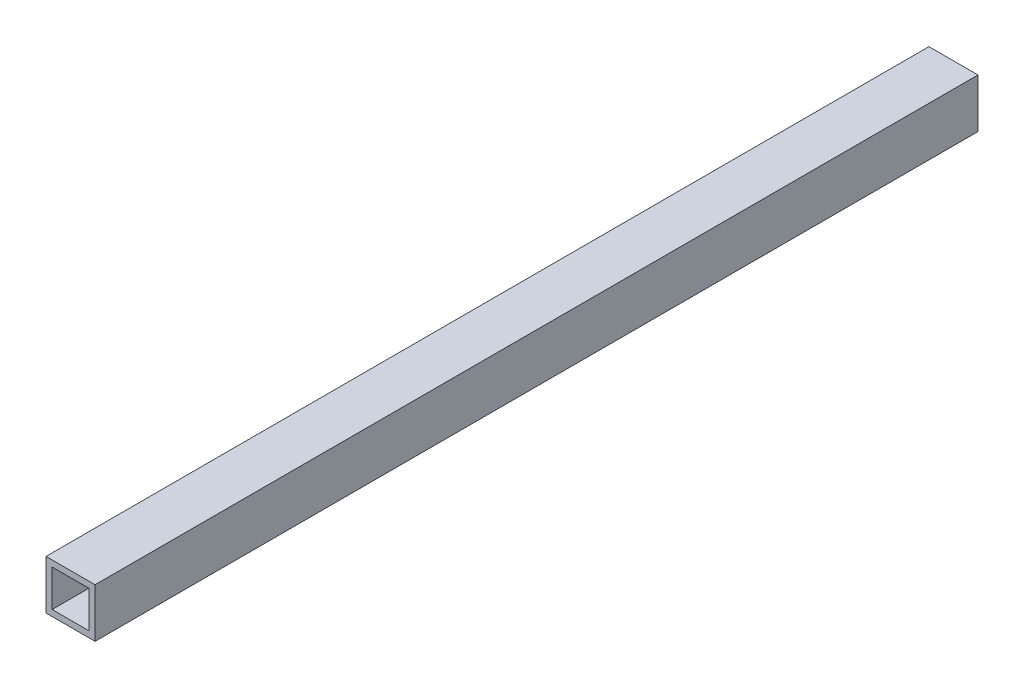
ISO-10303-21;
HEADER;
FILE_DESCRIPTION(('STEP AP214'),'2;1');
FILE_NAME('part.step','',(''),(''),'','','');
FILE_SCHEMA(('AUTOMOTIVE_DESIGN { 1 0 10303 214 1 1 1 1 }'));
ENDSEC;
DATA;
#1=APPLICATION_CONTEXT('core data for automotive mechanical design processes');
#2=APPLICATION_PROTOCOL_DEFINITION('international standard','automotive_design',2000,#1);
#3=PRODUCT_CONTEXT('',#1,'mechanical');
#4=PRODUCT('Part','Part','',(#3));
#5=PRODUCT_RELATED_PRODUCT_CATEGORY('part','',(#4));
#6=PRODUCT_DEFINITION_FORMATION('','',#4);
#7=PRODUCT_DEFINITION_CONTEXT('part definition',#1,'design');
#8=PRODUCT_DEFINITION('design','',#6,#7);
#9=PRODUCT_DEFINITION_SHAPE('','',#8);
#10=(LENGTH_UNIT() NAMED_UNIT(*) SI_UNIT(.MILLI.,.METRE.));
#11=(NAMED_UNIT(*) PLANE_ANGLE_UNIT() SI_UNIT($,.RADIAN.));
#12=(NAMED_UNIT(*) SI_UNIT($,.STERADIAN.) SOLID_ANGLE_UNIT());
#13=UNCERTAINTY_MEASURE_WITH_UNIT(LENGTH_MEASURE(1.E-05),#10,'distance_accuracy_value','');
#14=(GEOMETRIC_REPRESENTATION_CONTEXT(3) GLOBAL_UNCERTAINTY_ASSIGNED_CONTEXT((#13)) GLOBAL_UNIT_ASSIGNED_CONTEXT((#10,
#11,#12)) REPRESENTATION_CONTEXT('',''));
#15=CARTESIAN_POINT('',(0.,0.,0.));
#16=DIRECTION('',(0.,0.,1.));
#17=DIRECTION('',(1.,0.,0.));
#18=AXIS2_PLACEMENT_3D('',#15,#16,#17);
#19=CARTESIAN_POINT('',(0.,25.4,457.2));
#20=DIRECTION('',(0.,0.,-1.));
#21=DIRECTION('',(-1.,0.,0.));
#22=AXIS2_PLACEMENT_3D('',#19,#20,#21);
#23=PLANE('',#22);
#24=DIRECTION('',(0.,-1.,0.));
#25=VECTOR('',#24,1.);
#26=CARTESIAN_POINT('',(0.,0.,457.2));
#27=LINE('',#26,#25);
#28=CARTESIAN_POINT('',(0.,25.4,457.2));
#29=VERTEX_POINT('',#28);
#30=CARTESIAN_POINT('',(0.,0.,457.2));
#31=VERTEX_POINT('',#30);
#32=EDGE_CURVE('E132',#29,#31,#27,.T.);
#33=ORIENTED_EDGE('',*,*,#32,.T.);
#34=DIRECTION('',(1.,0.,0.));
#35=VECTOR('',#34,1.);
#36=CARTESIAN_POINT('',(0.,0.,457.2));
#37=LINE('',#36,#35);
#38=CARTESIAN_POINT('',(25.4,0.,457.2));
#39=VERTEX_POINT('',#38);
#40=EDGE_CURVE('E135',#31,#39,#37,.T.);
#41=ORIENTED_EDGE('',*,*,#40,.T.);
#42=DIRECTION('',(0.,1.,0.));
#43=VECTOR('',#42,1.);
#44=CARTESIAN_POINT('',(25.4,0.,457.2));
#45=LINE('',#44,#43);
#46=CARTESIAN_POINT('',(25.4,25.4,457.2));
#47=VERTEX_POINT('',#46);
#48=EDGE_CURVE('E138',#39,#47,#45,.T.);
#49=ORIENTED_EDGE('',*,*,#48,.T.);
#50=DIRECTION('',(-1.,0.,0.));
#51=VECTOR('',#50,1.);
#52=CARTESIAN_POINT('',(0.,25.4,457.2));
#53=LINE('',#52,#51);
#54=EDGE_CURVE('E140',#47,#29,#53,.T.);
#55=ORIENTED_EDGE('',*,*,#54,.T.);
#56=EDGE_LOOP('',(#33,#41,#49,#55));
#57=FACE_BOUND('',#56,.T.);
#58=DIRECTION('',(0.,-1.,0.));
#59=VECTOR('',#58,1.);
#60=CARTESIAN_POINT('',(3.175,3.175,457.2));
#61=LINE('',#60,#59);
#62=CARTESIAN_POINT('',(3.175,22.225,457.2));
#63=VERTEX_POINT('',#62);
#64=CARTESIAN_POINT('',(3.175,3.175,457.2));
#65=VERTEX_POINT('',#64);
#66=EDGE_CURVE('E96',#63,#65,#61,.T.);
#67=ORIENTED_EDGE('',*,*,#66,.F.);
#68=DIRECTION('',(-1.,0.,0.));
#69=VECTOR('',#68,1.);
#70=CARTESIAN_POINT('',(3.175,22.225,457.2));
#71=LINE('',#70,#69);
#72=CARTESIAN_POINT('',(22.225,22.225,457.2));
#73=VERTEX_POINT('',#72);
#74=EDGE_CURVE('E118',#73,#63,#71,.T.);
#75=ORIENTED_EDGE('',*,*,#74,.F.);
#76=DIRECTION('',(0.,1.,0.));
#77=VECTOR('',#76,1.);
#78=CARTESIAN_POINT('',(22.225,3.175,457.2));
#79=LINE('',#78,#77);
#80=CARTESIAN_POINT('',(22.225,3.175,457.2));
#81=VERTEX_POINT('',#80);
#82=EDGE_CURVE('E116',#81,#73,#79,.T.);
#83=ORIENTED_EDGE('',*,*,#82,.F.);
#84=DIRECTION('',(1.,0.,0.));
#85=VECTOR('',#84,1.);
#86=CARTESIAN_POINT('',(3.175,3.175,457.2));
#87=LINE('',#86,#85);
#88=EDGE_CURVE('E104',#65,#81,#87,.T.);
#89=ORIENTED_EDGE('',*,*,#88,.F.);
#90=EDGE_LOOP('',(#67,#75,#83,#89));
#91=FACE_BOUND('',#90,.T.);
#92=ADVANCED_FACE('F31',(#57,#91),#23,.F.);
#93=CARTESIAN_POINT('',(0.,25.4,0.));
#94=DIRECTION('',(0.,0.,-1.));
#95=DIRECTION('',(-1.,0.,0.));
#96=AXIS2_PLACEMENT_3D('',#93,#94,#95);
#97=PLANE('',#96);
#98=DIRECTION('',(0.,-1.,0.));
#99=VECTOR('',#98,1.);
#100=CARTESIAN_POINT('',(0.,0.,0.));
#101=LINE('',#100,#99);
#102=CARTESIAN_POINT('',(0.,25.4,0.));
#103=VERTEX_POINT('',#102);
#104=CARTESIAN_POINT('',(0.,0.,0.));
#105=VERTEX_POINT('',#104);
#106=EDGE_CURVE('E112',#103,#105,#101,.T.);
#107=ORIENTED_EDGE('',*,*,#106,.F.);
#108=DIRECTION('',(-1.,0.,0.));
#109=VECTOR('',#108,1.);
#110=CARTESIAN_POINT('',(0.,25.4,0.));
#111=LINE('',#110,#109);
#112=CARTESIAN_POINT('',(25.4,25.4,0.));
#113=VERTEX_POINT('',#112);
#114=EDGE_CURVE('E136',#113,#103,#111,.T.);
#115=ORIENTED_EDGE('',*,*,#114,.F.);
#116=DIRECTION('',(0.,1.,0.));
#117=VECTOR('',#116,1.);
#118=CARTESIAN_POINT('',(25.4,0.,0.));
#119=LINE('',#118,#117);
#120=CARTESIAN_POINT('',(25.4,0.,0.));
#121=VERTEX_POINT('',#120);
#122=EDGE_CURVE('E147',#121,#113,#119,.T.);
#123=ORIENTED_EDGE('',*,*,#122,.F.);
#124=DIRECTION('',(1.,0.,0.));
#125=VECTOR('',#124,1.);
#126=CARTESIAN_POINT('',(0.,0.,0.));
#127=LINE('',#126,#125);
#128=EDGE_CURVE('E145',#105,#121,#127,.T.);
#129=ORIENTED_EDGE('',*,*,#128,.F.);
#130=EDGE_LOOP('',(#107,#115,#123,#129));
#131=FACE_BOUND('',#130,.T.);
#132=DIRECTION('',(-1.,0.,0.));
#133=VECTOR('',#132,1.);
#134=CARTESIAN_POINT('',(3.175,22.225,0.));
#135=LINE('',#134,#133);
#136=CARTESIAN_POINT('',(22.225,22.225,0.));
#137=VERTEX_POINT('',#136);
#138=CARTESIAN_POINT('',(3.175,22.225,0.));
#139=VERTEX_POINT('',#138);
#140=EDGE_CURVE('E105',#137,#139,#135,.T.);
#141=ORIENTED_EDGE('',*,*,#140,.T.);
#142=DIRECTION('',(0.,-1.,0.));
#143=VECTOR('',#142,1.);
#144=CARTESIAN_POINT('',(3.175,3.175,0.));
#145=LINE('',#144,#143);
#146=CARTESIAN_POINT('',(3.175,3.175,0.));
#147=VERTEX_POINT('',#146);
#148=EDGE_CURVE('E54',#139,#147,#145,.T.);
#149=ORIENTED_EDGE('',*,*,#148,.T.);
#150=DIRECTION('',(1.,0.,0.));
#151=VECTOR('',#150,1.);
#152=CARTESIAN_POINT('',(3.175,3.175,0.));
#153=LINE('',#152,#151);
#154=CARTESIAN_POINT('',(22.225,3.175,0.));
#155=VERTEX_POINT('',#154);
#156=EDGE_CURVE('E111',#147,#155,#153,.T.);
#157=ORIENTED_EDGE('',*,*,#156,.T.);
#158=DIRECTION('',(0.,1.,0.));
#159=VECTOR('',#158,1.);
#160=CARTESIAN_POINT('',(22.225,3.175,0.));
#161=LINE('',#160,#159);
#162=EDGE_CURVE('E124',#155,#137,#161,.T.);
#163=ORIENTED_EDGE('',*,*,#162,.T.);
#164=EDGE_LOOP('',(#141,#149,#157,#163));
#165=FACE_BOUND('',#164,.T.);
#166=ADVANCED_FACE('F165',(#131,#165),#97,.T.);
#167=CARTESIAN_POINT('',(0.,0.,457.2));
#168=DIRECTION('',(1.,0.,0.));
#169=DIRECTION('',(0.,0.,-1.));
#170=AXIS2_PLACEMENT_3D('',#167,#168,#169);
#171=PLANE('',#170);
#172=ORIENTED_EDGE('',*,*,#106,.T.);
#173=DIRECTION('',(0.,0.,-1.));
#174=VECTOR('',#173,1.);
#175=CARTESIAN_POINT('',(0.,0.,457.2));
#176=LINE('',#175,#174);
#177=EDGE_CURVE('E11',#31,#105,#176,.T.);
#178=ORIENTED_EDGE('',*,*,#177,.F.);
#179=ORIENTED_EDGE('',*,*,#32,.F.);
#180=DIRECTION('',(0.,0.,-1.));
#181=VECTOR('',#180,1.);
#182=CARTESIAN_POINT('',(0.,25.4,457.2));
#183=LINE('',#182,#181);
#184=EDGE_CURVE('E142',#29,#103,#183,.T.);
#185=ORIENTED_EDGE('',*,*,#184,.T.);
#186=EDGE_LOOP('',(#172,#178,#179,#185));
#187=FACE_BOUND('',#186,.T.);
#188=ADVANCED_FACE('F33',(#187),#171,.F.);
#189=CARTESIAN_POINT('',(0.,0.,457.2));
#190=DIRECTION('',(0.,1.,0.));
#191=DIRECTION('',(0.,0.,1.));
#192=AXIS2_PLACEMENT_3D('',#189,#190,#191);
#193=PLANE('',#192);
#194=ORIENTED_EDGE('',*,*,#128,.T.);
#195=DIRECTION('',(0.,0.,-1.));
#196=VECTOR('',#195,1.);
#197=CARTESIAN_POINT('',(25.4,0.,457.2));
#198=LINE('',#197,#196);
#199=EDGE_CURVE('E39',#39,#121,#198,.T.);
#200=ORIENTED_EDGE('',*,*,#199,.F.);
#201=ORIENTED_EDGE('',*,*,#40,.F.);
#202=ORIENTED_EDGE('',*,*,#177,.T.);
#203=EDGE_LOOP('',(#194,#200,#201,#202));
#204=FACE_BOUND('',#203,.T.);
#205=ADVANCED_FACE('F175',(#204),#193,.F.);
#206=CARTESIAN_POINT('',(25.4,0.,457.2));
#207=DIRECTION('',(-1.,0.,0.));
#208=DIRECTION('',(0.,0.,1.));
#209=AXIS2_PLACEMENT_3D('',#206,#207,#208);
#210=PLANE('',#209);
#211=ORIENTED_EDGE('',*,*,#122,.T.);
#212=DIRECTION('',(0.,0.,-1.));
#213=VECTOR('',#212,1.);
#214=CARTESIAN_POINT('',(25.4,25.4,457.2));
#215=LINE('',#214,#213);
#216=EDGE_CURVE('E152',#47,#113,#215,.T.);
#217=ORIENTED_EDGE('',*,*,#216,.F.);
#218=ORIENTED_EDGE('',*,*,#48,.F.);
#219=ORIENTED_EDGE('',*,*,#199,.T.);
#220=EDGE_LOOP('',(#211,#217,#218,#219));
#221=FACE_BOUND('',#220,.T.);
#222=ADVANCED_FACE('F159',(#221),#210,.F.);
#223=CARTESIAN_POINT('',(0.,25.4,457.2));
#224=DIRECTION('',(0.,-1.,0.));
#225=DIRECTION('',(0.,0.,-1.));
#226=AXIS2_PLACEMENT_3D('',#223,#224,#225);
#227=PLANE('',#226);
#228=ORIENTED_EDGE('',*,*,#114,.T.);
#229=ORIENTED_EDGE('',*,*,#184,.F.);
#230=ORIENTED_EDGE('',*,*,#54,.F.);
#231=ORIENTED_EDGE('',*,*,#216,.T.);
#232=EDGE_LOOP('',(#228,#229,#230,#231));
#233=FACE_BOUND('',#232,.T.);
#234=ADVANCED_FACE('F169',(#233),#227,.F.);
#235=CARTESIAN_POINT('',(3.175,3.175,457.2));
#236=DIRECTION('',(1.,0.,0.));
#237=DIRECTION('',(0.,1.,0.));
#238=AXIS2_PLACEMENT_3D('',#235,#236,#237);
#239=PLANE('',#238);
#240=ORIENTED_EDGE('',*,*,#148,.F.);
#241=DIRECTION('',(0.,0.,-1.));
#242=VECTOR('',#241,1.);
#243=CARTESIAN_POINT('',(3.175,22.225,457.2));
#244=LINE('',#243,#242);
#245=EDGE_CURVE('E100',#63,#139,#244,.T.);
#246=ORIENTED_EDGE('',*,*,#245,.F.);
#247=ORIENTED_EDGE('',*,*,#66,.T.);
#248=DIRECTION('',(0.,0.,-1.));
#249=VECTOR('',#248,1.);
#250=CARTESIAN_POINT('',(3.175,3.175,457.2));
#251=LINE('',#250,#249);
#252=EDGE_CURVE('E99',#65,#147,#251,.T.);
#253=ORIENTED_EDGE('',*,*,#252,.T.);
#254=EDGE_LOOP('',(#240,#246,#247,#253));
#255=FACE_BOUND('',#254,.T.);
#256=ADVANCED_FACE('F98',(#255),#239,.T.);
#257=CARTESIAN_POINT('',(3.175,3.175,457.2));
#258=DIRECTION('',(0.,1.,0.));
#259=DIRECTION('',(0.,0.,1.));
#260=AXIS2_PLACEMENT_3D('',#257,#258,#259);
#261=PLANE('',#260);
#262=ORIENTED_EDGE('',*,*,#156,.F.);
#263=ORIENTED_EDGE('',*,*,#252,.F.);
#264=ORIENTED_EDGE('',*,*,#88,.T.);
#265=DIRECTION('',(0.,0.,-1.));
#266=VECTOR('',#265,1.);
#267=CARTESIAN_POINT('',(22.225,3.175,457.2));
#268=LINE('',#267,#266);
#269=EDGE_CURVE('E113',#81,#155,#268,.T.);
#270=ORIENTED_EDGE('',*,*,#269,.T.);
#271=EDGE_LOOP('',(#262,#263,#264,#270));
#272=FACE_BOUND('',#271,.T.);
#273=ADVANCED_FACE('F108',(#272),#261,.T.);
#274=CARTESIAN_POINT('',(22.225,3.175,457.2));
#275=DIRECTION('',(-1.,0.,0.));
#276=DIRECTION('',(0.,0.,1.));
#277=AXIS2_PLACEMENT_3D('',#274,#275,#276);
#278=PLANE('',#277);
#279=ORIENTED_EDGE('',*,*,#162,.F.);
#280=ORIENTED_EDGE('',*,*,#269,.F.);
#281=ORIENTED_EDGE('',*,*,#82,.T.);
#282=DIRECTION('',(0.,0.,-1.));
#283=VECTOR('',#282,1.);
#284=CARTESIAN_POINT('',(22.225,22.225,457.2));
#285=LINE('',#284,#283);
#286=EDGE_CURVE('E46',#73,#137,#285,.T.);
#287=ORIENTED_EDGE('',*,*,#286,.T.);
#288=EDGE_LOOP('',(#279,#280,#281,#287));
#289=FACE_BOUND('',#288,.T.);
#290=ADVANCED_FACE('F198',(#289),#278,.T.);
#291=CARTESIAN_POINT('',(3.175,22.225,457.2));
#292=DIRECTION('',(0.,-1.,0.));
#293=DIRECTION('',(0.,0.,-1.));
#294=AXIS2_PLACEMENT_3D('',#291,#292,#293);
#295=PLANE('',#294);
#296=ORIENTED_EDGE('',*,*,#140,.F.);
#297=ORIENTED_EDGE('',*,*,#286,.F.);
#298=ORIENTED_EDGE('',*,*,#74,.T.);
#299=ORIENTED_EDGE('',*,*,#245,.T.);
#300=EDGE_LOOP('',(#296,#297,#298,#299));
#301=FACE_BOUND('',#300,.T.);
#302=ADVANCED_FACE('F202',(#301),#295,.T.);
#303=CLOSED_SHELL('',(#92,#166,#188,#205,#222,#234,#256,#273,#290,#302));
#304=MANIFOLD_SOLID_BREP('B2',#303);
#305=ADVANCED_BREP_SHAPE_REPRESENTATION('',(#18,#304),#14);
#306=SHAPE_DEFINITION_REPRESENTATION(#9,#305);
ENDSEC;
END-ISO-10303-21;
